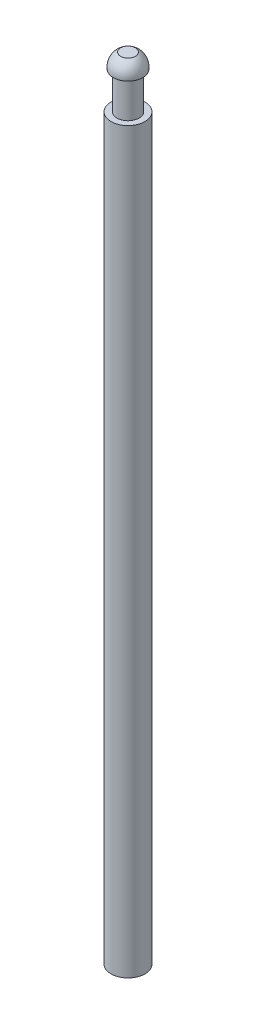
ISO-10303-21;
HEADER;
FILE_DESCRIPTION(('STEP AP214'),'2;1');
FILE_NAME('part.step','',(''),(''),'','','');
FILE_SCHEMA(('AUTOMOTIVE_DESIGN { 1 0 10303 214 1 1 1 1 }'));
ENDSEC;
DATA;
#1=APPLICATION_CONTEXT('core data for automotive mechanical design processes');
#2=APPLICATION_PROTOCOL_DEFINITION('international standard','automotive_design',2000,#1);
#3=PRODUCT_CONTEXT('',#1,'mechanical');
#4=PRODUCT('Part','Part','',(#3));
#5=PRODUCT_RELATED_PRODUCT_CATEGORY('part','',(#4));
#6=PRODUCT_DEFINITION_FORMATION('','',#4);
#7=PRODUCT_DEFINITION_CONTEXT('part definition',#1,'design');
#8=PRODUCT_DEFINITION('design','',#6,#7);
#9=PRODUCT_DEFINITION_SHAPE('','',#8);
#10=(LENGTH_UNIT() NAMED_UNIT(*) SI_UNIT(.MILLI.,.METRE.));
#11=(NAMED_UNIT(*) PLANE_ANGLE_UNIT() SI_UNIT($,.RADIAN.));
#12=(NAMED_UNIT(*) SI_UNIT($,.STERADIAN.) SOLID_ANGLE_UNIT());
#13=UNCERTAINTY_MEASURE_WITH_UNIT(LENGTH_MEASURE(1.E-05),#10,'distance_accuracy_value','');
#14=(GEOMETRIC_REPRESENTATION_CONTEXT(3) GLOBAL_UNCERTAINTY_ASSIGNED_CONTEXT((#13)) GLOBAL_UNIT_ASSIGNED_CONTEXT((#10,
#11,#12)) REPRESENTATION_CONTEXT('',''));
#15=CARTESIAN_POINT('',(0.,0.,0.));
#16=DIRECTION('',(0.,0.,1.));
#17=DIRECTION('',(1.,0.,0.));
#18=AXIS2_PLACEMENT_3D('',#15,#16,#17);
#19=CARTESIAN_POINT('',(0.,0.,0.));
#20=DIRECTION('',(0.,-1.,0.));
#21=DIRECTION('',(0.,0.,-1.));
#22=AXIS2_PLACEMENT_3D('',#19,#20,#21);
#23=CYLINDRICAL_SURFACE('',#22,0.75);
#24=CARTESIAN_POINT('',(0.,33.307250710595,0.));
#25=DIRECTION('',(0.,-1.,0.));
#26=DIRECTION('',(0.,0.,-1.));
#27=AXIS2_PLACEMENT_3D('',#24,#25,#26);
#28=CIRCLE('',#27,0.75);
#29=CARTESIAN_POINT('',(0.,33.307250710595,-0.75));
#30=VERTEX_POINT('',#29);
#31=EDGE_CURVE('E10',#30,#30,#28,.T.);
#32=ORIENTED_EDGE('',*,*,#31,.F.);
#33=EDGE_LOOP('',(#32));
#34=FACE_BOUND('',#33,.T.);
#35=CARTESIAN_POINT('',(0.,35.807250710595,0.));
#36=DIRECTION('',(0.,-1.,0.));
#37=DIRECTION('',(0.,0.,-1.));
#38=AXIS2_PLACEMENT_3D('',#35,#36,#37);
#39=CIRCLE('',#38,0.75);
#40=CARTESIAN_POINT('',(0.,35.807250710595,-0.75));
#41=VERTEX_POINT('',#40);
#42=EDGE_CURVE('E39',#41,#41,#39,.T.);
#43=ORIENTED_EDGE('',*,*,#42,.T.);
#44=EDGE_LOOP('',(#43));
#45=FACE_BOUND('',#44,.T.);
#46=ADVANCED_FACE('F33',(#34,#45),#23,.T.);
#47=CARTESIAN_POINT('',(-0.75,35.807250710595,0.));
#48=DIRECTION('',(0.,1.,0.));
#49=DIRECTION('',(0.,0.,1.));
#50=AXIS2_PLACEMENT_3D('',#47,#48,#49);
#51=PLANE('',#50);
#52=ORIENTED_EDGE('',*,*,#42,.F.);
#53=EDGE_LOOP('',(#52));
#54=FACE_BOUND('',#53,.T.);
#55=CARTESIAN_POINT('',(0.,35.807250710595,0.));
#56=DIRECTION('',(0.,-1.,0.));
#57=DIRECTION('',(0.,0.,-1.));
#58=AXIS2_PLACEMENT_3D('',#55,#56,#57);
#59=CIRCLE('',#58,1.);
#60=CARTESIAN_POINT('',(-1.,35.807250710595,0.));
#61=VERTEX_POINT('',#60);
#62=EDGE_CURVE('E43',#61,#61,#59,.T.);
#63=ORIENTED_EDGE('',*,*,#62,.T.);
#64=EDGE_LOOP('',(#63));
#65=FACE_BOUND('',#64,.T.);
#66=ADVANCED_FACE('F76',(#54,#65),#51,.F.);
#67=CARTESIAN_POINT('',(0.,35.932250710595,0.));
#68=DIRECTION('',(0.,-1.,0.));
#69=DIRECTION('',(-1.,0.,0.));
#70=AXIS2_PLACEMENT_3D('',#67,#68,#69);
#71=SPHERICAL_SURFACE('',#70,1.00778221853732);
#72=CARTESIAN_POINT('',(0.,36.807250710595,0.));
#73=DIRECTION('',(0.,-1.,0.));
#74=DIRECTION('',(0.,0.,-1.));
#75=AXIS2_PLACEMENT_3D('',#72,#73,#74);
#76=CIRCLE('',#75,0.5);
#77=CARTESIAN_POINT('',(-0.499999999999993,36.807250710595,0.));
#78=VERTEX_POINT('',#77);
#79=EDGE_CURVE('E47',#78,#78,#76,.T.);
#80=CARTESIAN_POINT('',(-1.,35.807250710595,0.));
#81=CARTESIAN_POINT('',(-1.00153136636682,35.8195007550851,0.));
#82=CARTESIAN_POINT('',(-1.00283742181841,35.8317789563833,0.));
#83=CARTESIAN_POINT('',(-1.00499762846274,35.8563750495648,0.));
#84=CARTESIAN_POINT('',(-1.00585177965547,35.8686929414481,0.));
#85=CARTESIAN_POINT('',(-1.00710689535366,35.8933517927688,0.));
#86=CARTESIAN_POINT('',(-1.00750785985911,35.9056927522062,0.));
#87=CARTESIAN_POINT('',(-1.00785609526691,35.9303810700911,0.));
#88=CARTESIAN_POINT('',(-1.00780336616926,35.9427284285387,0.));
#89=CARTESIAN_POINT('',(-1.00724427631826,35.9674128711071,0.));
#90=CARTESIAN_POINT('',(-1.00673791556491,35.9797499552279,0.));
#91=CARTESIAN_POINT('',(-1.00527224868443,36.0043971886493,0.));
#92=CARTESIAN_POINT('',(-1.00431294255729,36.0167073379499,0.));
#93=CARTESIAN_POINT('',(-1.001942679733,36.0412840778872,0.));
#94=CARTESIAN_POINT('',(-1.00053172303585,36.0535506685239,0.));
#95=CARTESIAN_POINT('',(-0.997260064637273,36.0780237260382,0.));
#96=CARTESIAN_POINT('',(-0.995399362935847,36.0902301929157,0.));
#97=CARTESIAN_POINT('',(-0.991230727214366,36.1145665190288,0.));
#98=CARTESIAN_POINT('',(-0.98892279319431,36.1266963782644,0.));
#99=CARTESIAN_POINT('',(-0.983862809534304,36.1508631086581,0.));
#100=CARTESIAN_POINT('',(-0.981110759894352,36.1628999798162,0.));
#101=CARTESIAN_POINT('',(-0.975166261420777,36.1868644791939,0.));
#102=CARTESIAN_POINT('',(-0.971973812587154,36.1987921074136,0.));
#103=CARTESIAN_POINT('',(-0.965152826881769,36.2225220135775,0.));
#104=CARTESIAN_POINT('',(-0.961524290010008,36.2343242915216,0.));
#105=CARTESIAN_POINT('',(-0.9538360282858,36.2577875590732,0.));
#106=CARTESIAN_POINT('',(-0.949776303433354,36.2694485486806,0.));
#107=CARTESIAN_POINT('',(-0.941231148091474,36.2926134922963,0.));
#108=CARTESIAN_POINT('',(-0.93674571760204,36.3041174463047,0.));
#109=CARTESIAN_POINT('',(-0.927355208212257,36.3269527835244,0.));
#110=CARTESIAN_POINT('',(-0.922450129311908,36.3382841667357,0.));
#111=CARTESIAN_POINT('',(-0.912226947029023,36.360759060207,0.));
#112=CARTESIAN_POINT('',(-0.906908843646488,36.371902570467,0.));
#113=CARTESIAN_POINT('',(-0.895866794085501,36.393986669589,0.));
#114=CARTESIAN_POINT('',(-0.890142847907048,36.404927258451,0.));
#115=CARTESIAN_POINT('',(-0.878296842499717,36.4265907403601,0.));
#116=CARTESIAN_POINT('',(-0.872174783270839,36.4373136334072,0.));
#117=CARTESIAN_POINT('',(-0.859540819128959,36.4585272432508,0.));
#118=CARTESIAN_POINT('',(-0.853028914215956,36.4690179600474,0.));
#119=CARTESIAN_POINT('',(-0.839624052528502,36.4897530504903,0.));
#120=CARTESIAN_POINT('',(-0.83273109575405,36.4999974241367,0.));
#121=CARTESIAN_POINT('',(-0.818573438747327,36.520225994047,0.));
#122=CARTESIAN_POINT('',(-0.811308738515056,36.5302101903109,0.));
#123=CARTESIAN_POINT('',(-0.796417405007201,36.5499049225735,0.));
#124=CARTESIAN_POINT('',(-0.788790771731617,36.5596154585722,0.));
#125=CARTESIAN_POINT('',(-0.77318587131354,36.5787497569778,0.));
#126=CARTESIAN_POINT('',(-0.765207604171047,36.5881735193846,0.));
#127=CARTESIAN_POINT('',(-0.74891021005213,36.6067215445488,0.));
#128=CARTESIAN_POINT('',(-0.740591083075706,36.6158458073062,0.));
#129=CARTESIAN_POINT('',(-0.723623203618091,36.6337825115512,0.));
#130=CARTESIAN_POINT('',(-0.714974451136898,36.6425949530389,0.));
#131=CARTESIAN_POINT('',(-0.697359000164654,36.6598961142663,0.));
#132=CARTESIAN_POINT('',(-0.688392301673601,36.668384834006,0.));
#133=CARTESIAN_POINT('',(-0.670153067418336,36.6850270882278,0.));
#134=CARTESIAN_POINT('',(-0.660880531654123,36.6931806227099,0.));
#135=CARTESIAN_POINT('',(-0.642042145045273,36.7091414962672,0.));
#136=CARTESIAN_POINT('',(-0.632476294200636,36.7169488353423,0.));
#137=CARTESIAN_POINT('',(-0.613064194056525,36.7322067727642,0.));
#138=CARTESIAN_POINT('',(-0.603217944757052,36.7396573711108,0.));
#139=CARTESIAN_POINT('',(-0.583258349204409,36.7541917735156,0.));
#140=CARTESIAN_POINT('',(-0.573145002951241,36.7612755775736,0.));
#141=CARTESIAN_POINT('',(-0.552664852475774,36.7750667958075,0.));
#142=CARTESIAN_POINT('',(-0.542298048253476,36.7817742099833,0.));
#143=CARTESIAN_POINT('',(-0.521325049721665,36.7948037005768,0.));
#144=CARTESIAN_POINT('',(-0.510718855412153,36.8011257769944,0.));
#145=CARTESIAN_POINT('',(-0.499999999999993,36.807250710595,0.));
#146=B_SPLINE_CURVE_WITH_KNOTS('',3,(#80,#81,#82,#83,#84,#85,#86,#87,#88,#89,#90,#91,#92,#93,
#94,#95,#96,#97,#98,#99,#100,#101,#102,#103,#104,#105,#106,#107,#108,#109,#110,#111,#112,#113,
#114,#115,#116,#117,#118,#119,#120,#121,#122,#123,#124,#125,#126,#127,#128,#129,#130,#131,#132,
#133,#134,#135,#136,#137,#138,#139,#140,#141,#142,#143,#144,#145),.UNSPECIFIED.,.F.,.F.,(4,2,2,
2,2,2,2,2,2,2,2,2,2,2,2,2,2,2,2,2,2,2,2,2,2,2,2,2,2,2,2,2,4),(0.,0.037034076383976,
0.0740681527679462,0.111102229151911,0.148136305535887,0.18517038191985,0.222204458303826,
0.259238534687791,0.296272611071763,0.33330668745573,0.370340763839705,0.407374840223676,
0.444408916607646,0.481442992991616,0.518477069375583,0.555511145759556,0.592545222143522,
0.629579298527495,0.666613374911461,0.703647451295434,0.740681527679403,0.777715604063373,
0.814749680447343,0.851783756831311,0.888817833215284,0.925851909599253,0.962885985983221,
0.999920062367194,1.03695413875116,1.07398821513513,1.1110222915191,1.14805636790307,
1.18509044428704),.UNSPECIFIED.);
#147=EDGE_CURVE('BSEAM81',#61,#78,#146,.T.);
#148=ORIENTED_EDGE('',*,*,#62,.F.);
#149=ORIENTED_EDGE('',*,*,#79,.T.);
#150=ORIENTED_EDGE('',*,*,#147,.T.);
#151=ORIENTED_EDGE('',*,*,#147,.F.);
#152=EDGE_LOOP('',(#148,#150,#149,#151));
#153=FACE_BOUND('',#152,.T.);
#154=ADVANCED_FACE('F81',(#153),#71,.T.);
#155=CARTESIAN_POINT('',(-0.5,36.807250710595,0.));
#156=DIRECTION('',(0.,-1.,0.));
#157=DIRECTION('',(0.,0.,-1.));
#158=AXIS2_PLACEMENT_3D('',#155,#156,#157);
#159=PLANE('',#158);
#160=ORIENTED_EDGE('',*,*,#79,.F.);
#161=EDGE_LOOP('',(#160));
#162=FACE_BOUND('',#161,.T.);
#163=ADVANCED_FACE('F64',(#162),#159,.F.);
#164=CARTESIAN_POINT('',(0.,-16.692749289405,0.));
#165=DIRECTION('',(0.,1.,0.));
#166=DIRECTION('',(0.,0.,1.));
#167=AXIS2_PLACEMENT_3D('',#164,#165,#166);
#168=CYLINDRICAL_SURFACE('',#167,1.15);
#169=CARTESIAN_POINT('',(0.,-16.692749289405,0.));
#170=DIRECTION('',(0.,-1.,0.));
#171=DIRECTION('',(0.,0.,-1.));
#172=AXIS2_PLACEMENT_3D('',#169,#170,#171);
#173=CIRCLE('',#172,1.15);
#174=CARTESIAN_POINT('',(0.,-16.692749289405,-1.15));
#175=VERTEX_POINT('',#174);
#176=EDGE_CURVE('E52',#175,#175,#173,.T.);
#177=ORIENTED_EDGE('',*,*,#176,.F.);
#178=EDGE_LOOP('',(#177));
#179=FACE_BOUND('',#178,.T.);
#180=CARTESIAN_POINT('',(0.,33.307250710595,0.));
#181=DIRECTION('',(0.,-1.,0.));
#182=DIRECTION('',(0.,0.,-1.));
#183=AXIS2_PLACEMENT_3D('',#180,#181,#182);
#184=CIRCLE('',#183,1.15);
#185=CARTESIAN_POINT('',(0.,33.307250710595,-1.15));
#186=VERTEX_POINT('',#185);
#187=EDGE_CURVE('E53',#186,#186,#184,.T.);
#188=ORIENTED_EDGE('',*,*,#187,.T.);
#189=EDGE_LOOP('',(#188));
#190=FACE_BOUND('',#189,.T.);
#191=ADVANCED_FACE('F61',(#179,#190),#168,.T.);
#192=CARTESIAN_POINT('',(0.,-16.692749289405,0.));
#193=DIRECTION('',(0.,-1.,0.));
#194=DIRECTION('',(0.,0.,-1.));
#195=AXIS2_PLACEMENT_3D('',#192,#193,#194);
#196=PLANE('',#195);
#197=ORIENTED_EDGE('',*,*,#176,.T.);
#198=EDGE_LOOP('',(#197));
#199=FACE_BOUND('',#198,.T.);
#200=ADVANCED_FACE('F59',(#199),#196,.T.);
#201=CARTESIAN_POINT('',(0.,33.307250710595,0.));
#202=DIRECTION('',(0.,-1.,0.));
#203=DIRECTION('',(0.,0.,-1.));
#204=AXIS2_PLACEMENT_3D('',#201,#202,#203);
#205=PLANE('',#204);
#206=ORIENTED_EDGE('',*,*,#31,.T.);
#207=EDGE_LOOP('',(#206));
#208=FACE_BOUND('',#207,.T.);
#209=ORIENTED_EDGE('',*,*,#187,.F.);
#210=EDGE_LOOP('',(#209));
#211=FACE_BOUND('',#210,.T.);
#212=ADVANCED_FACE('F68',(#208,#211),#205,.F.);
#213=CLOSED_SHELL('',(#46,#66,#154,#163,#191,#200,#212));
#214=MANIFOLD_SOLID_BREP('B2',#213);
#215=ADVANCED_BREP_SHAPE_REPRESENTATION('',(#18,#214),#14);
#216=SHAPE_DEFINITION_REPRESENTATION(#9,#215);
ENDSEC;
END-ISO-10303-21;
